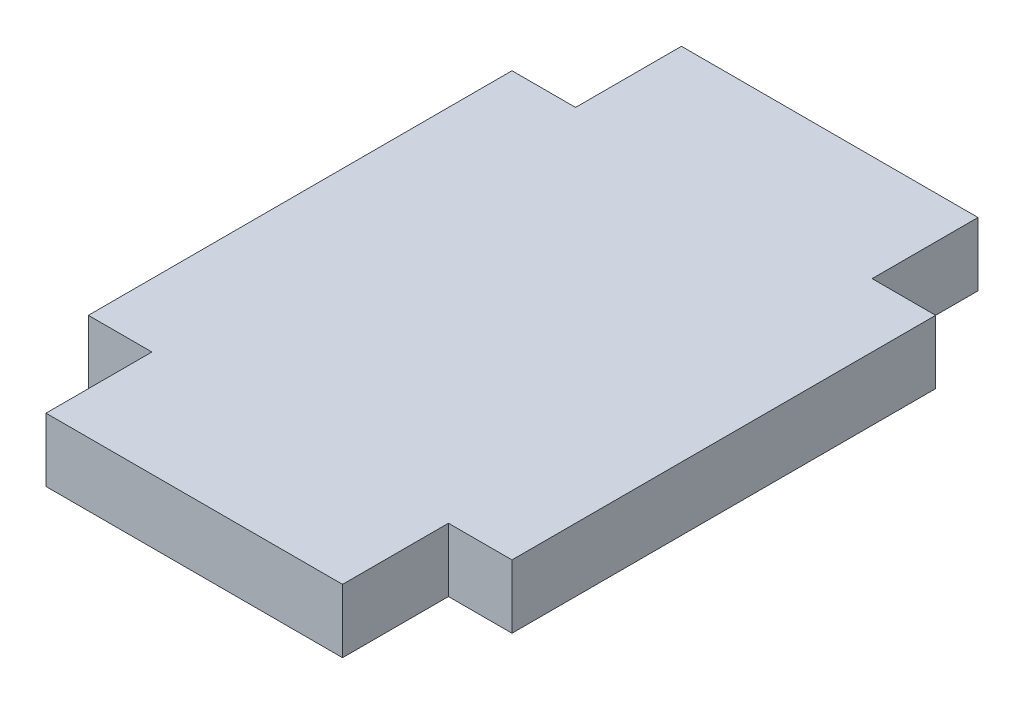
ISO-10303-21;
HEADER;
FILE_DESCRIPTION(('STEP AP214'),'2;1');
FILE_NAME('part.step','',(''),(''),'','','');
FILE_SCHEMA(('AUTOMOTIVE_DESIGN { 1 0 10303 214 1 1 1 1 }'));
ENDSEC;
DATA;
#1=APPLICATION_CONTEXT('core data for automotive mechanical design processes');
#2=APPLICATION_PROTOCOL_DEFINITION('international standard','automotive_design',2000,#1);
#3=PRODUCT_CONTEXT('',#1,'mechanical');
#4=PRODUCT('Part','Part','',(#3));
#5=PRODUCT_RELATED_PRODUCT_CATEGORY('part','',(#4));
#6=PRODUCT_DEFINITION_FORMATION('','',#4);
#7=PRODUCT_DEFINITION_CONTEXT('part definition',#1,'design');
#8=PRODUCT_DEFINITION('design','',#6,#7);
#9=PRODUCT_DEFINITION_SHAPE('','',#8);
#10=(LENGTH_UNIT() NAMED_UNIT(*) SI_UNIT(.MILLI.,.METRE.));
#11=(NAMED_UNIT(*) PLANE_ANGLE_UNIT() SI_UNIT($,.RADIAN.));
#12=(NAMED_UNIT(*) SI_UNIT($,.STERADIAN.) SOLID_ANGLE_UNIT());
#13=UNCERTAINTY_MEASURE_WITH_UNIT(LENGTH_MEASURE(1.E-05),#10,'distance_accuracy_value','');
#14=(GEOMETRIC_REPRESENTATION_CONTEXT(3) GLOBAL_UNCERTAINTY_ASSIGNED_CONTEXT((#13)) GLOBAL_UNIT_ASSIGNED_CONTEXT((#10,
#11,#12)) REPRESENTATION_CONTEXT('',''));
#15=CARTESIAN_POINT('',(0.,0.,0.));
#16=DIRECTION('',(0.,0.,1.));
#17=DIRECTION('',(1.,0.,0.));
#18=AXIS2_PLACEMENT_3D('',#15,#16,#17);
#19=CARTESIAN_POINT('',(14.,6.,20.));
#20=DIRECTION('',(-1.,0.,0.));
#21=DIRECTION('',(0.,0.,1.));
#22=AXIS2_PLACEMENT_3D('',#19,#20,#21);
#23=PLANE('',#22);
#24=DIRECTION('',(0.,0.,-1.));
#25=VECTOR('',#24,1.);
#26=CARTESIAN_POINT('',(14.,0.,20.));
#27=LINE('',#26,#25);
#28=CARTESIAN_POINT('',(14.,0.,30.));
#29=VERTEX_POINT('',#28);
#30=CARTESIAN_POINT('',(14.,0.,20.));
#31=VERTEX_POINT('',#30);
#32=EDGE_CURVE('E170',#29,#31,#27,.T.);
#33=ORIENTED_EDGE('',*,*,#32,.T.);
#34=DIRECTION('',(0.,-1.,0.));
#35=VECTOR('',#34,1.);
#36=CARTESIAN_POINT('',(14.,6.,20.));
#37=LINE('',#36,#35);
#38=CARTESIAN_POINT('',(14.,6.,20.));
#39=VERTEX_POINT('',#38);
#40=EDGE_CURVE('E11',#39,#31,#37,.T.);
#41=ORIENTED_EDGE('',*,*,#40,.F.);
#42=DIRECTION('',(0.,0.,-1.));
#43=VECTOR('',#42,1.);
#44=CARTESIAN_POINT('',(14.,6.,20.));
#45=LINE('',#44,#43);
#46=CARTESIAN_POINT('',(14.,6.,30.));
#47=VERTEX_POINT('',#46);
#48=EDGE_CURVE('E204',#47,#39,#45,.T.);
#49=ORIENTED_EDGE('',*,*,#48,.F.);
#50=DIRECTION('',(0.,-1.,0.));
#51=VECTOR('',#50,1.);
#52=CARTESIAN_POINT('',(14.,6.,30.));
#53=LINE('',#52,#51);
#54=EDGE_CURVE('E166',#47,#29,#53,.T.);
#55=ORIENTED_EDGE('',*,*,#54,.T.);
#56=EDGE_LOOP('',(#33,#41,#49,#55));
#57=FACE_BOUND('',#56,.T.);
#58=ADVANCED_FACE('F45',(#57),#23,.F.);
#59=CARTESIAN_POINT('',(14.,6.,20.));
#60=DIRECTION('',(0.,0.,-1.));
#61=DIRECTION('',(-1.,0.,0.));
#62=AXIS2_PLACEMENT_3D('',#59,#60,#61);
#63=PLANE('',#62);
#64=DIRECTION('',(1.,0.,0.));
#65=VECTOR('',#64,1.);
#66=CARTESIAN_POINT('',(14.,0.,20.));
#67=LINE('',#66,#65);
#68=CARTESIAN_POINT('',(20.,0.,20.));
#69=VERTEX_POINT('',#68);
#70=EDGE_CURVE('E174',#31,#69,#67,.T.);
#71=ORIENTED_EDGE('',*,*,#70,.T.);
#72=DIRECTION('',(0.,-1.,0.));
#73=VECTOR('',#72,1.);
#74=CARTESIAN_POINT('',(20.,6.,20.));
#75=LINE('',#74,#73);
#76=CARTESIAN_POINT('',(20.,6.,20.));
#77=VERTEX_POINT('',#76);
#78=EDGE_CURVE('E54',#77,#69,#75,.T.);
#79=ORIENTED_EDGE('',*,*,#78,.F.);
#80=DIRECTION('',(1.,0.,0.));
#81=VECTOR('',#80,1.);
#82=CARTESIAN_POINT('',(14.,6.,20.));
#83=LINE('',#82,#81);
#84=EDGE_CURVE('E117',#39,#77,#83,.T.);
#85=ORIENTED_EDGE('',*,*,#84,.F.);
#86=ORIENTED_EDGE('',*,*,#40,.T.);
#87=EDGE_LOOP('',(#71,#79,#85,#86));
#88=FACE_BOUND('',#87,.T.);
#89=ADVANCED_FACE('F298',(#88),#63,.F.);
#90=CARTESIAN_POINT('',(20.,6.,20.));
#91=DIRECTION('',(-1.,0.,0.));
#92=DIRECTION('',(0.,0.,1.));
#93=AXIS2_PLACEMENT_3D('',#90,#91,#92);
#94=PLANE('',#93);
#95=DIRECTION('',(0.,0.,-1.));
#96=VECTOR('',#95,1.);
#97=CARTESIAN_POINT('',(20.,0.,20.));
#98=LINE('',#97,#96);
#99=CARTESIAN_POINT('',(20.,0.,-20.));
#100=VERTEX_POINT('',#99);
#101=EDGE_CURVE('E177',#69,#100,#98,.T.);
#102=ORIENTED_EDGE('',*,*,#101,.T.);
#103=DIRECTION('',(0.,-1.,0.));
#104=VECTOR('',#103,1.);
#105=CARTESIAN_POINT('',(20.,6.,-20.));
#106=LINE('',#105,#104);
#107=CARTESIAN_POINT('',(20.,6.,-20.));
#108=VERTEX_POINT('',#107);
#109=EDGE_CURVE('E231',#108,#100,#106,.T.);
#110=ORIENTED_EDGE('',*,*,#109,.F.);
#111=DIRECTION('',(0.,0.,-1.));
#112=VECTOR('',#111,1.);
#113=CARTESIAN_POINT('',(20.,6.,20.));
#114=LINE('',#113,#112);
#115=EDGE_CURVE('E241',#77,#108,#114,.T.);
#116=ORIENTED_EDGE('',*,*,#115,.F.);
#117=ORIENTED_EDGE('',*,*,#78,.T.);
#118=EDGE_LOOP('',(#102,#110,#116,#117));
#119=FACE_BOUND('',#118,.T.);
#120=ADVANCED_FACE('F239',(#119),#94,.F.);
#121=CARTESIAN_POINT('',(20.,6.,-20.));
#122=DIRECTION('',(0.,0.,1.));
#123=DIRECTION('',(1.,0.,0.));
#124=AXIS2_PLACEMENT_3D('',#121,#122,#123);
#125=PLANE('',#124);
#126=DIRECTION('',(-1.,0.,0.));
#127=VECTOR('',#126,1.);
#128=CARTESIAN_POINT('',(20.,0.,-20.));
#129=LINE('',#128,#127);
#130=CARTESIAN_POINT('',(14.,0.,-20.));
#131=VERTEX_POINT('',#130);
#132=EDGE_CURVE('E180',#100,#131,#129,.T.);
#133=ORIENTED_EDGE('',*,*,#132,.T.);
#134=DIRECTION('',(0.,-1.,0.));
#135=VECTOR('',#134,1.);
#136=CARTESIAN_POINT('',(14.,6.,-20.));
#137=LINE('',#136,#135);
#138=CARTESIAN_POINT('',(14.,6.,-20.));
#139=VERTEX_POINT('',#138);
#140=EDGE_CURVE('E227',#139,#131,#137,.T.);
#141=ORIENTED_EDGE('',*,*,#140,.F.);
#142=DIRECTION('',(-1.,0.,0.));
#143=VECTOR('',#142,1.);
#144=CARTESIAN_POINT('',(20.,6.,-20.));
#145=LINE('',#144,#143);
#146=EDGE_CURVE('E260',#108,#139,#145,.T.);
#147=ORIENTED_EDGE('',*,*,#146,.F.);
#148=ORIENTED_EDGE('',*,*,#109,.T.);
#149=EDGE_LOOP('',(#133,#141,#147,#148));
#150=FACE_BOUND('',#149,.T.);
#151=ADVANCED_FACE('F250',(#150),#125,.F.);
#152=CARTESIAN_POINT('',(14.,6.,-30.));
#153=DIRECTION('',(-1.,0.,0.));
#154=DIRECTION('',(0.,0.,1.));
#155=AXIS2_PLACEMENT_3D('',#152,#153,#154);
#156=PLANE('',#155);
#157=DIRECTION('',(0.,0.,-1.));
#158=VECTOR('',#157,1.);
#159=CARTESIAN_POINT('',(14.,0.,-30.));
#160=LINE('',#159,#158);
#161=CARTESIAN_POINT('',(14.,0.,-30.));
#162=VERTEX_POINT('',#161);
#163=EDGE_CURVE('E183',#131,#162,#160,.T.);
#164=ORIENTED_EDGE('',*,*,#163,.T.);
#165=DIRECTION('',(0.,-1.,0.));
#166=VECTOR('',#165,1.);
#167=CARTESIAN_POINT('',(14.,6.,-30.));
#168=LINE('',#167,#166);
#169=CARTESIAN_POINT('',(14.,6.,-30.));
#170=VERTEX_POINT('',#169);
#171=EDGE_CURVE('E223',#170,#162,#168,.T.);
#172=ORIENTED_EDGE('',*,*,#171,.F.);
#173=DIRECTION('',(0.,0.,-1.));
#174=VECTOR('',#173,1.);
#175=CARTESIAN_POINT('',(14.,6.,-30.));
#176=LINE('',#175,#174);
#177=EDGE_CURVE('E256',#139,#170,#176,.T.);
#178=ORIENTED_EDGE('',*,*,#177,.F.);
#179=ORIENTED_EDGE('',*,*,#140,.T.);
#180=EDGE_LOOP('',(#164,#172,#178,#179));
#181=FACE_BOUND('',#180,.T.);
#182=ADVANCED_FACE('F254',(#181),#156,.F.);
#183=CARTESIAN_POINT('',(-14.,6.,-30.));
#184=DIRECTION('',(0.,0.,1.));
#185=DIRECTION('',(1.,0.,0.));
#186=AXIS2_PLACEMENT_3D('',#183,#184,#185);
#187=PLANE('',#186);
#188=DIRECTION('',(-1.,0.,0.));
#189=VECTOR('',#188,1.);
#190=CARTESIAN_POINT('',(-14.,0.,-30.));
#191=LINE('',#190,#189);
#192=CARTESIAN_POINT('',(-14.,0.,-30.));
#193=VERTEX_POINT('',#192);
#194=EDGE_CURVE('E186',#162,#193,#191,.T.);
#195=ORIENTED_EDGE('',*,*,#194,.T.);
#196=DIRECTION('',(0.,-1.,0.));
#197=VECTOR('',#196,1.);
#198=CARTESIAN_POINT('',(-14.,6.,-30.));
#199=LINE('',#198,#197);
#200=CARTESIAN_POINT('',(-14.,6.,-30.));
#201=VERTEX_POINT('',#200);
#202=EDGE_CURVE('E219',#201,#193,#199,.T.);
#203=ORIENTED_EDGE('',*,*,#202,.F.);
#204=DIRECTION('',(-1.,0.,0.));
#205=VECTOR('',#204,1.);
#206=CARTESIAN_POINT('',(-14.,6.,-30.));
#207=LINE('',#206,#205);
#208=EDGE_CURVE('E259',#170,#201,#207,.T.);
#209=ORIENTED_EDGE('',*,*,#208,.F.);
#210=ORIENTED_EDGE('',*,*,#171,.T.);
#211=EDGE_LOOP('',(#195,#203,#209,#210));
#212=FACE_BOUND('',#211,.T.);
#213=ADVANCED_FACE('F311',(#212),#187,.F.);
#214=CARTESIAN_POINT('',(-14.,6.,-30.));
#215=DIRECTION('',(1.,0.,0.));
#216=DIRECTION('',(0.,0.,-1.));
#217=AXIS2_PLACEMENT_3D('',#214,#215,#216);
#218=PLANE('',#217);
#219=DIRECTION('',(0.,0.,1.));
#220=VECTOR('',#219,1.);
#221=CARTESIAN_POINT('',(-14.,0.,-30.));
#222=LINE('',#221,#220);
#223=CARTESIAN_POINT('',(-14.,0.,-20.));
#224=VERTEX_POINT('',#223);
#225=EDGE_CURVE('E189',#193,#224,#222,.T.);
#226=ORIENTED_EDGE('',*,*,#225,.T.);
#227=DIRECTION('',(0.,-1.,0.));
#228=VECTOR('',#227,1.);
#229=CARTESIAN_POINT('',(-14.,6.,-20.));
#230=LINE('',#229,#228);
#231=CARTESIAN_POINT('',(-14.,6.,-20.));
#232=VERTEX_POINT('',#231);
#233=EDGE_CURVE('E215',#232,#224,#230,.T.);
#234=ORIENTED_EDGE('',*,*,#233,.F.);
#235=DIRECTION('',(0.,0.,1.));
#236=VECTOR('',#235,1.);
#237=CARTESIAN_POINT('',(-14.,6.,-30.));
#238=LINE('',#237,#236);
#239=EDGE_CURVE('E264',#201,#232,#238,.T.);
#240=ORIENTED_EDGE('',*,*,#239,.F.);
#241=ORIENTED_EDGE('',*,*,#202,.T.);
#242=EDGE_LOOP('',(#226,#234,#240,#241));
#243=FACE_BOUND('',#242,.T.);
#244=ADVANCED_FACE('F314',(#243),#218,.F.);
#245=CARTESIAN_POINT('',(-20.,6.,-20.));
#246=DIRECTION('',(0.,0.,1.));
#247=DIRECTION('',(1.,0.,0.));
#248=AXIS2_PLACEMENT_3D('',#245,#246,#247);
#249=PLANE('',#248);
#250=DIRECTION('',(-1.,0.,0.));
#251=VECTOR('',#250,1.);
#252=CARTESIAN_POINT('',(-20.,0.,-20.));
#253=LINE('',#252,#251);
#254=CARTESIAN_POINT('',(-20.,0.,-20.));
#255=VERTEX_POINT('',#254);
#256=EDGE_CURVE('E192',#224,#255,#253,.T.);
#257=ORIENTED_EDGE('',*,*,#256,.T.);
#258=DIRECTION('',(0.,-1.,0.));
#259=VECTOR('',#258,1.);
#260=CARTESIAN_POINT('',(-20.,6.,-20.));
#261=LINE('',#260,#259);
#262=CARTESIAN_POINT('',(-20.,6.,-20.));
#263=VERTEX_POINT('',#262);
#264=EDGE_CURVE('E211',#263,#255,#261,.T.);
#265=ORIENTED_EDGE('',*,*,#264,.F.);
#266=DIRECTION('',(-1.,0.,0.));
#267=VECTOR('',#266,1.);
#268=CARTESIAN_POINT('',(-20.,6.,-20.));
#269=LINE('',#268,#267);
#270=EDGE_CURVE('E271',#232,#263,#269,.T.);
#271=ORIENTED_EDGE('',*,*,#270,.F.);
#272=ORIENTED_EDGE('',*,*,#233,.T.);
#273=EDGE_LOOP('',(#257,#265,#271,#272));
#274=FACE_BOUND('',#273,.T.);
#275=ADVANCED_FACE('F279',(#274),#249,.F.);
#276=CARTESIAN_POINT('',(-20.,6.,20.));
#277=DIRECTION('',(1.,0.,0.));
#278=DIRECTION('',(0.,0.,-1.));
#279=AXIS2_PLACEMENT_3D('',#276,#277,#278);
#280=PLANE('',#279);
#281=DIRECTION('',(0.,0.,1.));
#282=VECTOR('',#281,1.);
#283=CARTESIAN_POINT('',(-20.,0.,20.));
#284=LINE('',#283,#282);
#285=CARTESIAN_POINT('',(-20.,0.,20.));
#286=VERTEX_POINT('',#285);
#287=EDGE_CURVE('E195',#255,#286,#284,.T.);
#288=ORIENTED_EDGE('',*,*,#287,.T.);
#289=DIRECTION('',(0.,-1.,0.));
#290=VECTOR('',#289,1.);
#291=CARTESIAN_POINT('',(-20.,6.,20.));
#292=LINE('',#291,#290);
#293=CARTESIAN_POINT('',(-20.,6.,20.));
#294=VERTEX_POINT('',#293);
#295=EDGE_CURVE('E159',#294,#286,#292,.T.);
#296=ORIENTED_EDGE('',*,*,#295,.F.);
#297=DIRECTION('',(0.,0.,1.));
#298=VECTOR('',#297,1.);
#299=CARTESIAN_POINT('',(-20.,6.,20.));
#300=LINE('',#299,#298);
#301=EDGE_CURVE('E148',#263,#294,#300,.T.);
#302=ORIENTED_EDGE('',*,*,#301,.F.);
#303=ORIENTED_EDGE('',*,*,#264,.T.);
#304=EDGE_LOOP('',(#288,#296,#302,#303));
#305=FACE_BOUND('',#304,.T.);
#306=ADVANCED_FACE('F283',(#305),#280,.F.);
#307=CARTESIAN_POINT('',(-14.,6.,20.));
#308=DIRECTION('',(0.,0.,-1.));
#309=DIRECTION('',(-1.,0.,0.));
#310=AXIS2_PLACEMENT_3D('',#307,#308,#309);
#311=PLANE('',#310);
#312=DIRECTION('',(1.,0.,0.));
#313=VECTOR('',#312,1.);
#314=CARTESIAN_POINT('',(-14.,0.,20.));
#315=LINE('',#314,#313);
#316=CARTESIAN_POINT('',(-14.,0.,20.));
#317=VERTEX_POINT('',#316);
#318=EDGE_CURVE('E157',#286,#317,#315,.T.);
#319=ORIENTED_EDGE('',*,*,#318,.T.);
#320=DIRECTION('',(0.,-1.,0.));
#321=VECTOR('',#320,1.);
#322=CARTESIAN_POINT('',(-14.,6.,20.));
#323=LINE('',#322,#321);
#324=CARTESIAN_POINT('',(-14.,6.,20.));
#325=VERTEX_POINT('',#324);
#326=EDGE_CURVE('E154',#325,#317,#323,.T.);
#327=ORIENTED_EDGE('',*,*,#326,.F.);
#328=DIRECTION('',(1.,0.,0.));
#329=VECTOR('',#328,1.);
#330=CARTESIAN_POINT('',(-14.,6.,20.));
#331=LINE('',#330,#329);
#332=EDGE_CURVE('E142',#294,#325,#331,.T.);
#333=ORIENTED_EDGE('',*,*,#332,.F.);
#334=ORIENTED_EDGE('',*,*,#295,.T.);
#335=EDGE_LOOP('',(#319,#327,#333,#334));
#336=FACE_BOUND('',#335,.T.);
#337=ADVANCED_FACE('F155',(#336),#311,.F.);
#338=CARTESIAN_POINT('',(-14.,6.,20.));
#339=DIRECTION('',(1.,0.,0.));
#340=DIRECTION('',(0.,0.,-1.));
#341=AXIS2_PLACEMENT_3D('',#338,#339,#340);
#342=PLANE('',#341);
#343=DIRECTION('',(0.,0.,1.));
#344=VECTOR('',#343,1.);
#345=CARTESIAN_POINT('',(-14.,0.,20.));
#346=LINE('',#345,#344);
#347=CARTESIAN_POINT('',(-14.,0.,30.));
#348=VERTEX_POINT('',#347);
#349=EDGE_CURVE('E103',#317,#348,#346,.T.);
#350=ORIENTED_EDGE('',*,*,#349,.T.);
#351=DIRECTION('',(0.,-1.,0.));
#352=VECTOR('',#351,1.);
#353=CARTESIAN_POINT('',(-14.,6.,30.));
#354=LINE('',#353,#352);
#355=CARTESIAN_POINT('',(-14.,6.,30.));
#356=VERTEX_POINT('',#355);
#357=EDGE_CURVE('E160',#356,#348,#354,.T.);
#358=ORIENTED_EDGE('',*,*,#357,.F.);
#359=DIRECTION('',(0.,0.,1.));
#360=VECTOR('',#359,1.);
#361=CARTESIAN_POINT('',(-14.,6.,20.));
#362=LINE('',#361,#360);
#363=EDGE_CURVE('E146',#325,#356,#362,.T.);
#364=ORIENTED_EDGE('',*,*,#363,.F.);
#365=ORIENTED_EDGE('',*,*,#326,.T.);
#366=EDGE_LOOP('',(#350,#358,#364,#365));
#367=FACE_BOUND('',#366,.T.);
#368=ADVANCED_FACE('F162',(#367),#342,.F.);
#369=CARTESIAN_POINT('',(-14.,6.,30.));
#370=DIRECTION('',(0.,0.,-1.));
#371=DIRECTION('',(-1.,0.,0.));
#372=AXIS2_PLACEMENT_3D('',#369,#370,#371);
#373=PLANE('',#372);
#374=DIRECTION('',(1.,0.,0.));
#375=VECTOR('',#374,1.);
#376=CARTESIAN_POINT('',(-14.,0.,30.));
#377=LINE('',#376,#375);
#378=EDGE_CURVE('E109',#348,#29,#377,.T.);
#379=ORIENTED_EDGE('',*,*,#378,.T.);
#380=ORIENTED_EDGE('',*,*,#54,.F.);
#381=DIRECTION('',(1.,0.,0.));
#382=VECTOR('',#381,1.);
#383=CARTESIAN_POINT('',(-14.,6.,30.));
#384=LINE('',#383,#382);
#385=EDGE_CURVE('E62',#356,#47,#384,.T.);
#386=ORIENTED_EDGE('',*,*,#385,.F.);
#387=ORIENTED_EDGE('',*,*,#357,.T.);
#388=EDGE_LOOP('',(#379,#380,#386,#387));
#389=FACE_BOUND('',#388,.T.);
#390=ADVANCED_FACE('F287',(#389),#373,.F.);
#391=CARTESIAN_POINT('',(0.,6.,0.));
#392=DIRECTION('',(0.,1.,0.));
#393=DIRECTION('',(0.,0.,1.));
#394=AXIS2_PLACEMENT_3D('',#391,#392,#393);
#395=PLANE('',#394);
#396=ORIENTED_EDGE('',*,*,#48,.T.);
#397=ORIENTED_EDGE('',*,*,#84,.T.);
#398=ORIENTED_EDGE('',*,*,#115,.T.);
#399=ORIENTED_EDGE('',*,*,#146,.T.);
#400=ORIENTED_EDGE('',*,*,#177,.T.);
#401=ORIENTED_EDGE('',*,*,#208,.T.);
#402=ORIENTED_EDGE('',*,*,#239,.T.);
#403=ORIENTED_EDGE('',*,*,#270,.T.);
#404=ORIENTED_EDGE('',*,*,#301,.T.);
#405=ORIENTED_EDGE('',*,*,#332,.T.);
#406=ORIENTED_EDGE('',*,*,#363,.T.);
#407=ORIENTED_EDGE('',*,*,#385,.T.);
#408=EDGE_LOOP('',(#396,#397,#398,#399,#400,#401,#402,#403,#404,#405,#406,#407));
#409=FACE_BOUND('',#408,.T.);
#410=ADVANCED_FACE('F144',(#409),#395,.T.);
#411=CARTESIAN_POINT('',(0.,0.,0.));
#412=DIRECTION('',(0.,1.,0.));
#413=DIRECTION('',(0.,0.,1.));
#414=AXIS2_PLACEMENT_3D('',#411,#412,#413);
#415=PLANE('',#414);
#416=ORIENTED_EDGE('',*,*,#32,.F.);
#417=ORIENTED_EDGE('',*,*,#378,.F.);
#418=ORIENTED_EDGE('',*,*,#349,.F.);
#419=ORIENTED_EDGE('',*,*,#318,.F.);
#420=ORIENTED_EDGE('',*,*,#287,.F.);
#421=ORIENTED_EDGE('',*,*,#256,.F.);
#422=ORIENTED_EDGE('',*,*,#225,.F.);
#423=ORIENTED_EDGE('',*,*,#194,.F.);
#424=ORIENTED_EDGE('',*,*,#163,.F.);
#425=ORIENTED_EDGE('',*,*,#132,.F.);
#426=ORIENTED_EDGE('',*,*,#101,.F.);
#427=ORIENTED_EDGE('',*,*,#70,.F.);
#428=EDGE_LOOP('',(#416,#417,#418,#419,#420,#421,#422,#423,#424,#425,#426,#427));
#429=FACE_BOUND('',#428,.T.);
#430=ADVANCED_FACE('F245',(#429),#415,.F.);
#431=CLOSED_SHELL('',(#58,#89,#120,#151,#182,#213,#244,#275,#306,#337,#368,#390,#410,#430));
#432=MANIFOLD_SOLID_BREP('B2',#431);
#433=ADVANCED_BREP_SHAPE_REPRESENTATION('',(#18,#432),#14);
#434=SHAPE_DEFINITION_REPRESENTATION(#9,#433);
ENDSEC;
END-ISO-10303-21;
